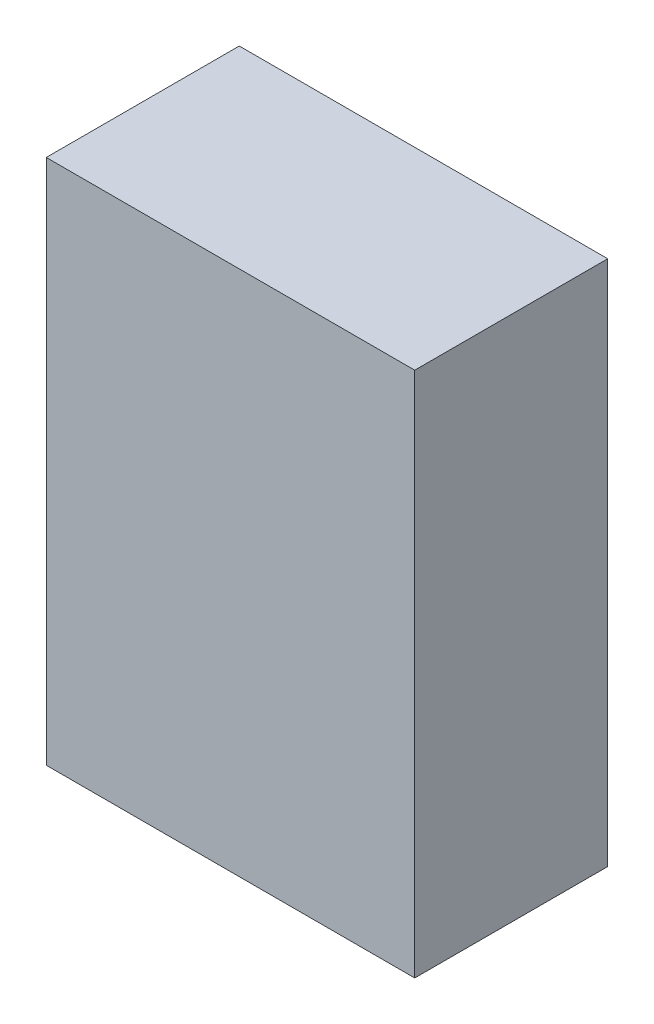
from build123d import *

# Parameters (mm, degrees)
GENERAL_W           = 2.100000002
GENERAL_H           = 3
BOSS_EXTRUDE1_DEPTH = 1.1


with BuildPart() as part:
    # GENERAL → Boss-Extrude1 (new body)
    with BuildSketch(Plane.XY):
        Rectangle(GENERAL_W, GENERAL_H)
    extrude(amount=BOSS_EXTRUDE1_DEPTH)


solid = part.part
